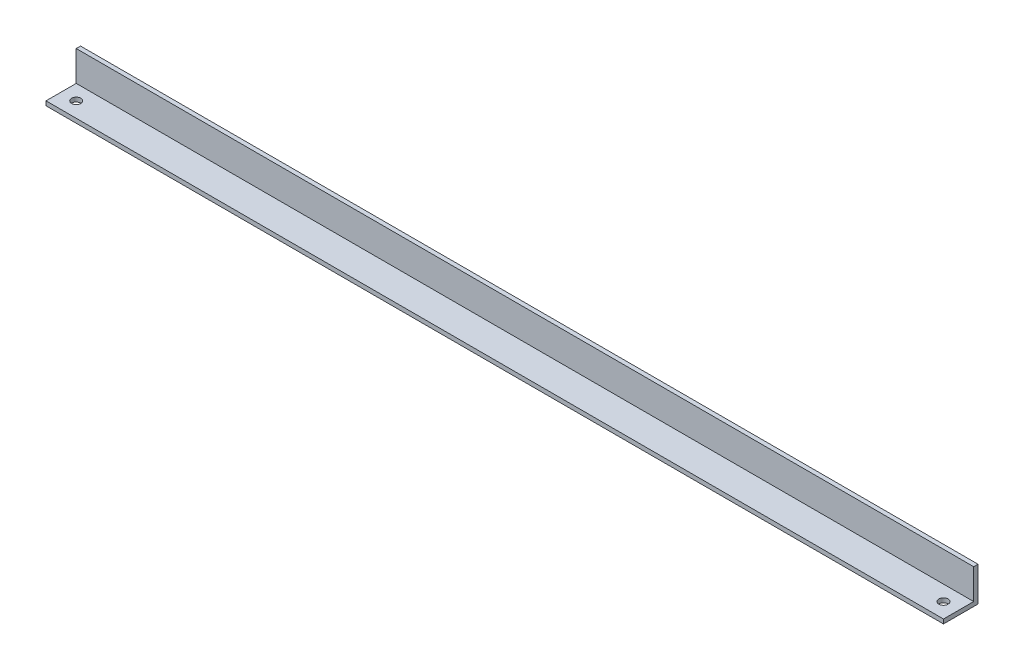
from build123d import *

# Parameters (mm, degrees)
SKETCH1_W           = 660.4
SKETCH1_H           = 25.4
BOSS_EXTRUDE1_DEPTH = 3.175
SKETCH2_W           = 660.4
SKETCH2_H           = 3.175
BOSS_EXTRUDE2_DEPTH = 22.225
SKETCH3_R           = 3.3782
CUT_EXTRUDE1_DEPTH  = 332.190701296


with BuildPart() as part:
    # Sketch1 → Boss-Extrude1 (new body)
    with BuildSketch(Plane(origin=(0, 0, 0), x_dir=(1, 0, 0), z_dir=(0, 1, 0))):
        Rectangle(SKETCH1_W, SKETCH1_H)
    extrude(amount=BOSS_EXTRUDE1_DEPTH)

    # Sketch2 → Boss-Extrude2 (add)
    with BuildSketch(Plane(origin=(0, 3.175, 0), x_dir=(1, 0, 0), z_dir=(0, 1, 0))):
        with Locations((0, 11.1125)):
            Rectangle(SKETCH2_W, SKETCH2_H)
    extrude(amount=BOSS_EXTRUDE2_DEPTH)

    # Sketch3 → Cut-Extrude1 (cut, through all)
    with BuildSketch(Plane(origin=(0, 3.175, 0), x_dir=(1, 0, 0), z_dir=(0, 1, 0))):
        with Locations(Location((-319.0875, -1.5875, 0), (0, 0, 270))):
            Circle(SKETCH3_R)
        with Locations(Location((319.0875, -1.5875, 0), (0, 0, 270))):
            Circle(SKETCH3_R)
    extrude(amount=-CUT_EXTRUDE1_DEPTH, mode=Mode.SUBTRACT)


solid = part.part
